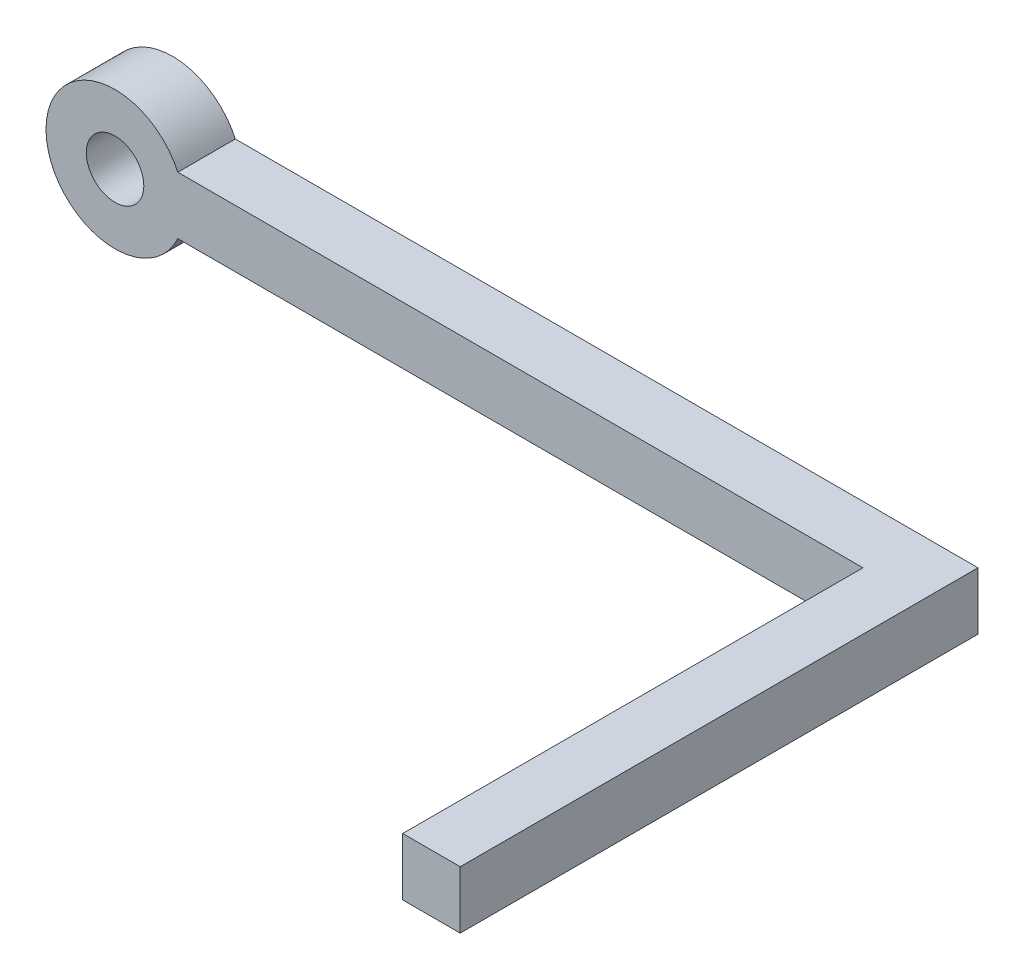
ISO-10303-21;
HEADER;
FILE_DESCRIPTION(('STEP AP214'),'2;1');
FILE_NAME('part.step','',(''),(''),'','','');
FILE_SCHEMA(('AUTOMOTIVE_DESIGN { 1 0 10303 214 1 1 1 1 }'));
ENDSEC;
DATA;
#1=APPLICATION_CONTEXT('core data for automotive mechanical design processes');
#2=APPLICATION_PROTOCOL_DEFINITION('international standard','automotive_design',2000,#1);
#3=PRODUCT_CONTEXT('',#1,'mechanical');
#4=PRODUCT('Part','Part','',(#3));
#5=PRODUCT_RELATED_PRODUCT_CATEGORY('part','',(#4));
#6=PRODUCT_DEFINITION_FORMATION('','',#4);
#7=PRODUCT_DEFINITION_CONTEXT('part definition',#1,'design');
#8=PRODUCT_DEFINITION('design','',#6,#7);
#9=PRODUCT_DEFINITION_SHAPE('','',#8);
#10=(LENGTH_UNIT() NAMED_UNIT(*) SI_UNIT(.MILLI.,.METRE.));
#11=(NAMED_UNIT(*) PLANE_ANGLE_UNIT() SI_UNIT($,.RADIAN.));
#12=(NAMED_UNIT(*) SI_UNIT($,.STERADIAN.) SOLID_ANGLE_UNIT());
#13=UNCERTAINTY_MEASURE_WITH_UNIT(LENGTH_MEASURE(1.E-05),#10,'distance_accuracy_value','');
#14=(GEOMETRIC_REPRESENTATION_CONTEXT(3) GLOBAL_UNCERTAINTY_ASSIGNED_CONTEXT((#13)) GLOBAL_UNIT_ASSIGNED_CONTEXT((#10,
#11,#12)) REPRESENTATION_CONTEXT('',''));
#15=CARTESIAN_POINT('',(0.,0.,0.));
#16=DIRECTION('',(0.,0.,1.));
#17=DIRECTION('',(1.,0.,0.));
#18=AXIS2_PLACEMENT_3D('',#15,#16,#17);
#19=CARTESIAN_POINT('',(0.,0.,3.175));
#20=DIRECTION('',(0.,0.,-1.));
#21=DIRECTION('',(-1.,0.,0.));
#22=AXIS2_PLACEMENT_3D('',#19,#20,#21);
#23=CYLINDRICAL_SURFACE('',#22,3.81);
#24=CARTESIAN_POINT('',(0.,0.,3.175));
#25=DIRECTION('',(0.,0.,1.));
#26=DIRECTION('',(1.,0.,0.));
#27=AXIS2_PLACEMENT_3D('',#24,#25,#26);
#28=CIRCLE('',#27,3.81);
#29=CARTESIAN_POINT('',(3.46351609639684,1.5875,3.175));
#30=VERTEX_POINT('',#29);
#31=CARTESIAN_POINT('',(3.46351609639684,-1.5875,3.175));
#32=VERTEX_POINT('',#31);
#33=EDGE_CURVE('E11',#30,#32,#28,.T.);
#34=ORIENTED_EDGE('',*,*,#33,.F.);
#35=DIRECTION('',(0.,0.,-1.));
#36=VECTOR('',#35,1.);
#37=CARTESIAN_POINT('',(3.46351609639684,1.5875,3.175));
#38=LINE('',#37,#36);
#39=CARTESIAN_POINT('',(3.46351609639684,1.5875,0.));
#40=VERTEX_POINT('',#39);
#41=EDGE_CURVE('E145',#30,#40,#38,.T.);
#42=ORIENTED_EDGE('',*,*,#41,.T.);
#43=CARTESIAN_POINT('',(0.,0.,0.));
#44=DIRECTION('',(0.,0.,1.));
#45=DIRECTION('',(1.,0.,0.));
#46=AXIS2_PLACEMENT_3D('',#43,#44,#45);
#47=CIRCLE('',#46,3.81);
#48=CARTESIAN_POINT('',(3.46351609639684,-1.5875,0.));
#49=VERTEX_POINT('',#48);
#50=EDGE_CURVE('E41',#40,#49,#47,.T.);
#51=ORIENTED_EDGE('',*,*,#50,.T.);
#52=DIRECTION('',(0.,0.,-1.));
#53=VECTOR('',#52,1.);
#54=CARTESIAN_POINT('',(3.46351609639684,-1.5875,3.175));
#55=LINE('',#54,#53);
#56=EDGE_CURVE('E95',#49,#32,#55,.F.);
#57=ORIENTED_EDGE('',*,*,#56,.T.);
#58=EDGE_LOOP('',(#34,#42,#51,#57));
#59=FACE_BOUND('',#58,.T.);
#60=ADVANCED_FACE('F33',(#59),#23,.T.);
#61=CARTESIAN_POINT('',(0.,0.,3.175));
#62=DIRECTION('',(0.,0.,1.));
#63=DIRECTION('',(1.,0.,0.));
#64=AXIS2_PLACEMENT_3D('',#61,#62,#63);
#65=PLANE('',#64);
#66=DIRECTION('',(0.,-1.,0.));
#67=VECTOR('',#66,1.);
#68=CARTESIAN_POINT('',(41.275,1.5875,3.175));
#69=LINE('',#68,#67);
#70=CARTESIAN_POINT('',(41.275,1.5875,3.175));
#71=VERTEX_POINT('',#70);
#72=CARTESIAN_POINT('',(41.275,-1.5875,3.175));
#73=VERTEX_POINT('',#72);
#74=EDGE_CURVE('E49',#71,#73,#69,.T.);
#75=ORIENTED_EDGE('',*,*,#74,.F.);
#76=DIRECTION('',(-1.,0.,0.));
#77=VECTOR('',#76,1.);
#78=CARTESIAN_POINT('',(0.,1.5875,3.175));
#79=LINE('',#78,#77);
#80=EDGE_CURVE('E52',#71,#30,#79,.T.);
#81=ORIENTED_EDGE('',*,*,#80,.T.);
#82=ORIENTED_EDGE('',*,*,#33,.T.);
#83=DIRECTION('',(1.,0.,0.));
#84=VECTOR('',#83,1.);
#85=CARTESIAN_POINT('',(0.,-1.5875,3.175));
#86=LINE('',#85,#84);
#87=EDGE_CURVE('E134',#32,#73,#86,.T.);
#88=ORIENTED_EDGE('',*,*,#87,.T.);
#89=EDGE_LOOP('',(#75,#81,#82,#88));
#90=FACE_BOUND('',#89,.T.);
#91=CARTESIAN_POINT('',(0.,0.,3.175));
#92=DIRECTION('',(0.,0.,1.));
#93=DIRECTION('',(1.,0.,0.));
#94=AXIS2_PLACEMENT_3D('',#91,#92,#93);
#95=CIRCLE('',#94,1.5875);
#96=CARTESIAN_POINT('',(1.5875,0.,3.175));
#97=VERTEX_POINT('',#96);
#98=EDGE_CURVE('E128',#97,#97,#95,.T.);
#99=ORIENTED_EDGE('',*,*,#98,.F.);
#100=EDGE_LOOP('',(#99));
#101=FACE_BOUND('',#100,.T.);
#102=ADVANCED_FACE('F159',(#90,#101),#65,.T.);
#103=CARTESIAN_POINT('',(0.,0.,0.));
#104=DIRECTION('',(0.,0.,1.));
#105=DIRECTION('',(1.,0.,0.));
#106=AXIS2_PLACEMENT_3D('',#103,#104,#105);
#107=PLANE('',#106);
#108=CARTESIAN_POINT('',(0.,0.,0.));
#109=DIRECTION('',(0.,0.,1.));
#110=DIRECTION('',(1.,0.,0.));
#111=AXIS2_PLACEMENT_3D('',#108,#109,#110);
#112=CIRCLE('',#111,1.5875);
#113=CARTESIAN_POINT('',(1.5875,0.,0.));
#114=VERTEX_POINT('',#113);
#115=EDGE_CURVE('E119',#114,#114,#112,.T.);
#116=ORIENTED_EDGE('',*,*,#115,.T.);
#117=EDGE_LOOP('',(#116));
#118=FACE_BOUND('',#117,.T.);
#119=ORIENTED_EDGE('',*,*,#50,.F.);
#120=DIRECTION('',(-1.,0.,0.));
#121=VECTOR('',#120,1.);
#122=CARTESIAN_POINT('',(0.,1.5875,0.));
#123=LINE('',#122,#121);
#124=CARTESIAN_POINT('',(44.45,1.5875,0.));
#125=VERTEX_POINT('',#124);
#126=EDGE_CURVE('E139',#125,#40,#123,.T.);
#127=ORIENTED_EDGE('',*,*,#126,.F.);
#128=DIRECTION('',(0.,1.,0.));
#129=VECTOR('',#128,1.);
#130=CARTESIAN_POINT('',(44.45,-1.5875,0.));
#131=LINE('',#130,#129);
#132=CARTESIAN_POINT('',(44.45,-1.5875,0.));
#133=VERTEX_POINT('',#132);
#134=EDGE_CURVE('E92',#133,#125,#131,.T.);
#135=ORIENTED_EDGE('',*,*,#134,.F.);
#136=DIRECTION('',(1.,0.,0.));
#137=VECTOR('',#136,1.);
#138=CARTESIAN_POINT('',(0.,-1.5875,0.));
#139=LINE('',#138,#137);
#140=EDGE_CURVE('E136',#49,#133,#139,.T.);
#141=ORIENTED_EDGE('',*,*,#140,.F.);
#142=EDGE_LOOP('',(#119,#127,#135,#141));
#143=FACE_BOUND('',#142,.T.);
#144=ADVANCED_FACE('F156',(#118,#143),#107,.F.);
#145=CARTESIAN_POINT('',(0.,1.5875,0.));
#146=DIRECTION('',(0.,1.,0.));
#147=DIRECTION('',(0.,0.,1.));
#148=AXIS2_PLACEMENT_3D('',#145,#146,#147);
#149=PLANE('',#148);
#150=ORIENTED_EDGE('',*,*,#41,.F.);
#151=ORIENTED_EDGE('',*,*,#80,.F.);
#152=DIRECTION('',(0.,0.,-1.));
#153=VECTOR('',#152,1.);
#154=CARTESIAN_POINT('',(41.275,1.5875,28.575));
#155=LINE('',#154,#153);
#156=CARTESIAN_POINT('',(41.275,1.5875,28.575));
#157=VERTEX_POINT('',#156);
#158=EDGE_CURVE('E102',#157,#71,#155,.T.);
#159=ORIENTED_EDGE('',*,*,#158,.F.);
#160=DIRECTION('',(-1.,0.,0.));
#161=VECTOR('',#160,1.);
#162=CARTESIAN_POINT('',(44.45,1.5875,28.575));
#163=LINE('',#162,#161);
#164=CARTESIAN_POINT('',(44.45,1.5875,28.575));
#165=VERTEX_POINT('',#164);
#166=EDGE_CURVE('E99',#165,#157,#163,.T.);
#167=ORIENTED_EDGE('',*,*,#166,.F.);
#168=DIRECTION('',(0.,0.,1.));
#169=VECTOR('',#168,1.);
#170=CARTESIAN_POINT('',(44.45,1.5875,0.));
#171=LINE('',#170,#169);
#172=EDGE_CURVE('E85',#125,#165,#171,.T.);
#173=ORIENTED_EDGE('',*,*,#172,.F.);
#174=ORIENTED_EDGE('',*,*,#126,.T.);
#175=EDGE_LOOP('',(#150,#151,#159,#167,#173,#174));
#176=FACE_BOUND('',#175,.T.);
#177=ADVANCED_FACE('F100',(#176),#149,.T.);
#178=CARTESIAN_POINT('',(0.,-1.5875,0.));
#179=DIRECTION('',(0.,-1.,0.));
#180=DIRECTION('',(0.,0.,-1.));
#181=AXIS2_PLACEMENT_3D('',#178,#179,#180);
#182=PLANE('',#181);
#183=ORIENTED_EDGE('',*,*,#56,.F.);
#184=ORIENTED_EDGE('',*,*,#140,.T.);
#185=DIRECTION('',(0.,0.,1.));
#186=VECTOR('',#185,1.);
#187=CARTESIAN_POINT('',(44.45,-1.5875,0.));
#188=LINE('',#187,#186);
#189=CARTESIAN_POINT('',(44.45,-1.5875,28.575));
#190=VERTEX_POINT('',#189);
#191=EDGE_CURVE('E96',#133,#190,#188,.T.);
#192=ORIENTED_EDGE('',*,*,#191,.T.);
#193=DIRECTION('',(1.,0.,0.));
#194=VECTOR('',#193,1.);
#195=CARTESIAN_POINT('',(41.275,-1.5875,28.575));
#196=LINE('',#195,#194);
#197=CARTESIAN_POINT('',(41.275,-1.5875,28.575));
#198=VERTEX_POINT('',#197);
#199=EDGE_CURVE('E110',#198,#190,#196,.T.);
#200=ORIENTED_EDGE('',*,*,#199,.F.);
#201=DIRECTION('',(0.,0.,-1.));
#202=VECTOR('',#201,1.);
#203=CARTESIAN_POINT('',(41.275,-1.5875,28.575));
#204=LINE('',#203,#202);
#205=EDGE_CURVE('E116',#198,#73,#204,.T.);
#206=ORIENTED_EDGE('',*,*,#205,.T.);
#207=ORIENTED_EDGE('',*,*,#87,.F.);
#208=EDGE_LOOP('',(#183,#184,#192,#200,#206,#207));
#209=FACE_BOUND('',#208,.T.);
#210=ADVANCED_FACE('F152',(#209),#182,.T.);
#211=CARTESIAN_POINT('',(44.45,-1.5875,0.));
#212=DIRECTION('',(1.,0.,0.));
#213=DIRECTION('',(0.,0.,-1.));
#214=AXIS2_PLACEMENT_3D('',#211,#212,#213);
#215=PLANE('',#214);
#216=ORIENTED_EDGE('',*,*,#172,.T.);
#217=DIRECTION('',(0.,1.,0.));
#218=VECTOR('',#217,1.);
#219=CARTESIAN_POINT('',(44.45,-1.5875,28.575));
#220=LINE('',#219,#218);
#221=EDGE_CURVE('E90',#190,#165,#220,.T.);
#222=ORIENTED_EDGE('',*,*,#221,.F.);
#223=ORIENTED_EDGE('',*,*,#191,.F.);
#224=ORIENTED_EDGE('',*,*,#134,.T.);
#225=EDGE_LOOP('',(#216,#222,#223,#224));
#226=FACE_BOUND('',#225,.T.);
#227=ADVANCED_FACE('F87',(#226),#215,.T.);
#228=CARTESIAN_POINT('',(0.,0.,0.));
#229=DIRECTION('',(0.,0.,1.));
#230=DIRECTION('',(1.,0.,0.));
#231=AXIS2_PLACEMENT_3D('',#228,#229,#230);
#232=CYLINDRICAL_SURFACE('',#231,1.5875);
#233=ORIENTED_EDGE('',*,*,#115,.F.);
#234=EDGE_LOOP('',(#233));
#235=FACE_BOUND('',#234,.T.);
#236=ORIENTED_EDGE('',*,*,#98,.T.);
#237=EDGE_LOOP('',(#236));
#238=FACE_BOUND('',#237,.T.);
#239=ADVANCED_FACE('F164',(#235,#238),#232,.F.);
#240=CARTESIAN_POINT('',(41.275,1.5875,28.575));
#241=DIRECTION('',(1.,0.,0.));
#242=DIRECTION('',(0.,1.,0.));
#243=AXIS2_PLACEMENT_3D('',#240,#241,#242);
#244=PLANE('',#243);
#245=ORIENTED_EDGE('',*,*,#74,.T.);
#246=ORIENTED_EDGE('',*,*,#205,.F.);
#247=DIRECTION('',(0.,-1.,0.));
#248=VECTOR('',#247,1.);
#249=CARTESIAN_POINT('',(41.275,1.5875,28.575));
#250=LINE('',#249,#248);
#251=EDGE_CURVE('E105',#157,#198,#250,.T.);
#252=ORIENTED_EDGE('',*,*,#251,.F.);
#253=ORIENTED_EDGE('',*,*,#158,.T.);
#254=EDGE_LOOP('',(#245,#246,#252,#253));
#255=FACE_BOUND('',#254,.T.);
#256=ADVANCED_FACE('F162',(#255),#244,.F.);
#257=CARTESIAN_POINT('',(44.45,1.5875,28.575));
#258=DIRECTION('',(0.,0.,1.));
#259=DIRECTION('',(1.,0.,0.));
#260=AXIS2_PLACEMENT_3D('',#257,#258,#259);
#261=PLANE('',#260);
#262=ORIENTED_EDGE('',*,*,#221,.T.);
#263=ORIENTED_EDGE('',*,*,#166,.T.);
#264=ORIENTED_EDGE('',*,*,#251,.T.);
#265=ORIENTED_EDGE('',*,*,#199,.T.);
#266=EDGE_LOOP('',(#262,#263,#264,#265));
#267=FACE_BOUND('',#266,.T.);
#268=ADVANCED_FACE('F108',(#267),#261,.T.);
#269=CLOSED_SHELL('',(#60,#102,#144,#177,#210,#227,#239,#256,#268));
#270=MANIFOLD_SOLID_BREP('B2',#269);
#271=ADVANCED_BREP_SHAPE_REPRESENTATION('',(#18,#270),#14);
#272=SHAPE_DEFINITION_REPRESENTATION(#9,#271);
ENDSEC;
END-ISO-10303-21;
